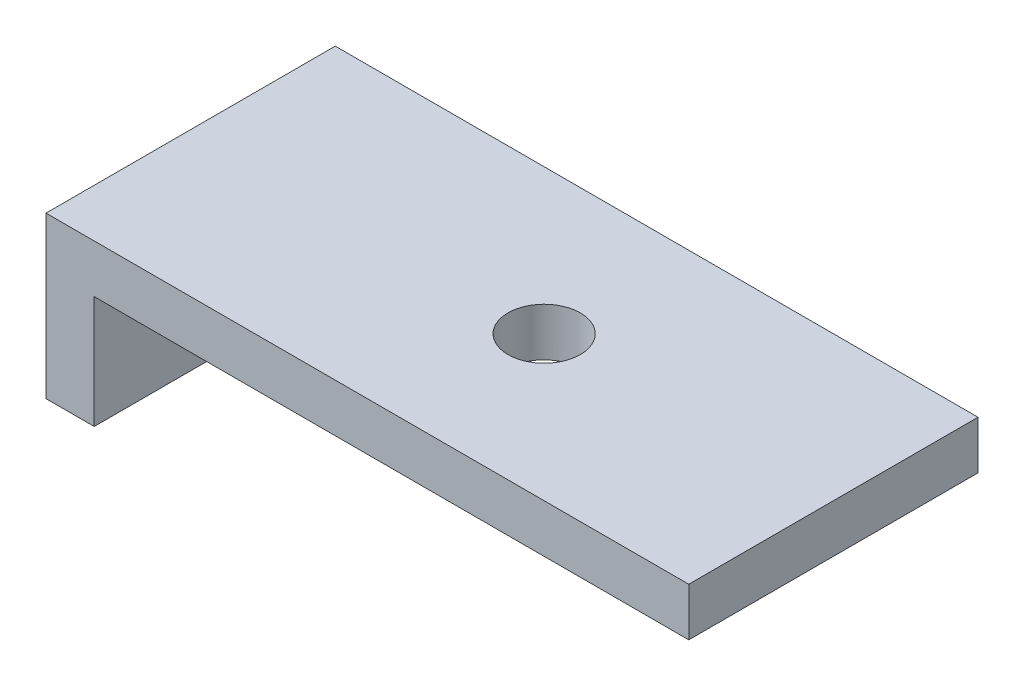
from build123d import *

# Parameters (mm, degrees)
BOSS_EXTRUDE1_DEPTH = 18
SKETCH2_R           = 2.25
CUT_EXTRUDE1_DEPTH  = 10


with BuildPart() as part:
    # Sketch1 → Boss-Extrude1 (new body)
    with BuildSketch(Plane.XY):
        Polygon((0, 0), (-3, 0), (-3, 10), (37, 10), (37, 7), (0, 7), align=None)
    extrude(amount=BOSS_EXTRUDE1_DEPTH)

    # Sketch2 → Cut-Extrude1 (cut)
    with BuildSketch(Plane(origin=(0, 10, 0), x_dir=(1, 0, 0), z_dir=(0, 1, 0))):
        with Locations(Location((19, -9, 0), (0, 0, 270))):
            Circle(SKETCH2_R)
    extrude(amount=-CUT_EXTRUDE1_DEPTH, mode=Mode.SUBTRACT)


solid = part.part
